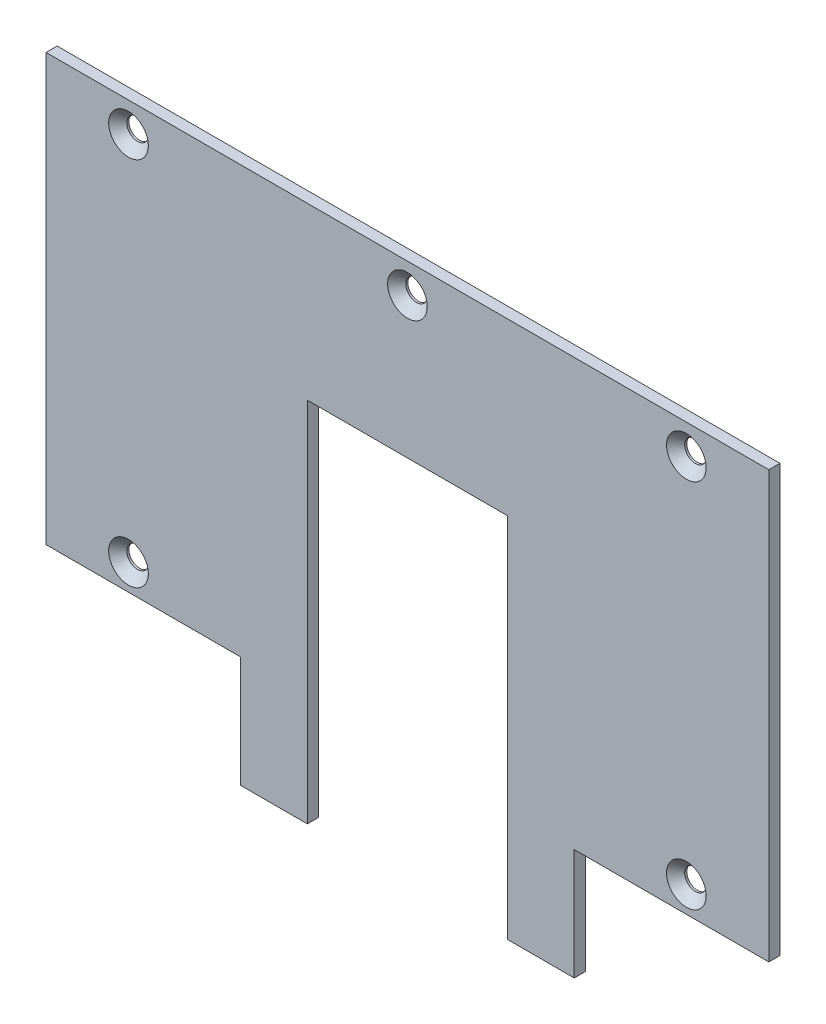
ISO-10303-21;
HEADER;
FILE_DESCRIPTION(('STEP AP214'),'2;1');
FILE_NAME('part.step','',(''),(''),'','','');
FILE_SCHEMA(('AUTOMOTIVE_DESIGN { 1 0 10303 214 1 1 1 1 }'));
ENDSEC;
DATA;
#1=APPLICATION_CONTEXT('core data for automotive mechanical design processes');
#2=APPLICATION_PROTOCOL_DEFINITION('international standard','automotive_design',2000,#1);
#3=PRODUCT_CONTEXT('',#1,'mechanical');
#4=PRODUCT('Part','Part','',(#3));
#5=PRODUCT_RELATED_PRODUCT_CATEGORY('part','',(#4));
#6=PRODUCT_DEFINITION_FORMATION('','',#4);
#7=PRODUCT_DEFINITION_CONTEXT('part definition',#1,'design');
#8=PRODUCT_DEFINITION('design','',#6,#7);
#9=PRODUCT_DEFINITION_SHAPE('','',#8);
#10=(LENGTH_UNIT() NAMED_UNIT(*) SI_UNIT(.MILLI.,.METRE.));
#11=(NAMED_UNIT(*) PLANE_ANGLE_UNIT() SI_UNIT($,.RADIAN.));
#12=(NAMED_UNIT(*) SI_UNIT($,.STERADIAN.) SOLID_ANGLE_UNIT());
#13=UNCERTAINTY_MEASURE_WITH_UNIT(LENGTH_MEASURE(1.E-05),#10,'distance_accuracy_value','');
#14=(GEOMETRIC_REPRESENTATION_CONTEXT(3) GLOBAL_UNCERTAINTY_ASSIGNED_CONTEXT((#13)) GLOBAL_UNIT_ASSIGNED_CONTEXT((#10,
#11,#12)) REPRESENTATION_CONTEXT('',''));
#15=CARTESIAN_POINT('',(0.,0.,0.));
#16=DIRECTION('',(0.,0.,1.));
#17=DIRECTION('',(1.,0.,0.));
#18=AXIS2_PLACEMENT_3D('',#15,#16,#17);
#19=CARTESIAN_POINT('',(0.,31.9897494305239,0.));
#20=DIRECTION('',(0.,0.,1.));
#21=DIRECTION('',(1.,0.,0.));
#22=AXIS2_PLACEMENT_3D('',#19,#20,#21);
#23=PLANE('',#22);
#24=CARTESIAN_POINT('',(-75.25,-8.00000000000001,0.));
#25=DIRECTION('',(0.,0.,1.));
#26=DIRECTION('',(1.,0.,0.));
#27=AXIS2_PLACEMENT_3D('',#24,#25,#26);
#28=CIRCLE('',#27,5.34999999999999);
#29=CARTESIAN_POINT('',(-69.9,-8.00000000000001,0.));
#30=VERTEX_POINT('',#29);
#31=EDGE_CURVE('E125',#30,#30,#28,.F.);
#32=ORIENTED_EDGE('',*,*,#31,.T.);
#33=EDGE_LOOP('',(#32));
#34=FACE_BOUND('',#33,.T.);
#35=CARTESIAN_POINT('',(-75.25,92.,0.));
#36=DIRECTION('',(0.,0.,1.));
#37=DIRECTION('',(1.,0.,0.));
#38=AXIS2_PLACEMENT_3D('',#35,#36,#37);
#39=CIRCLE('',#38,5.34999999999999);
#40=CARTESIAN_POINT('',(-69.9,92.,0.));
#41=VERTEX_POINT('',#40);
#42=EDGE_CURVE('E148',#41,#41,#39,.F.);
#43=ORIENTED_EDGE('',*,*,#42,.T.);
#44=EDGE_LOOP('',(#43));
#45=FACE_BOUND('',#44,.T.);
#46=CARTESIAN_POINT('',(0.,92.,0.));
#47=DIRECTION('',(0.,0.,1.));
#48=DIRECTION('',(1.,0.,0.));
#49=AXIS2_PLACEMENT_3D('',#46,#47,#48);
#50=CIRCLE('',#49,5.35);
#51=CARTESIAN_POINT('',(5.35000000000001,92.,0.));
#52=VERTEX_POINT('',#51);
#53=EDGE_CURVE('E151',#52,#52,#50,.F.);
#54=ORIENTED_EDGE('',*,*,#53,.T.);
#55=EDGE_LOOP('',(#54));
#56=FACE_BOUND('',#55,.T.);
#57=CARTESIAN_POINT('',(75.25,92.,0.));
#58=DIRECTION('',(0.,0.,1.));
#59=DIRECTION('',(1.,0.,0.));
#60=AXIS2_PLACEMENT_3D('',#57,#58,#59);
#61=CIRCLE('',#60,5.35);
#62=CARTESIAN_POINT('',(80.6,92.,0.));
#63=VERTEX_POINT('',#62);
#64=EDGE_CURVE('E153',#63,#63,#61,.F.);
#65=ORIENTED_EDGE('',*,*,#64,.T.);
#66=EDGE_LOOP('',(#65));
#67=FACE_BOUND('',#66,.T.);
#68=CARTESIAN_POINT('',(75.25,-8.,0.));
#69=DIRECTION('',(0.,0.,1.));
#70=DIRECTION('',(1.,0.,0.));
#71=AXIS2_PLACEMENT_3D('',#68,#69,#70);
#72=CIRCLE('',#71,5.35);
#73=CARTESIAN_POINT('',(80.6,-8.,0.));
#74=VERTEX_POINT('',#73);
#75=EDGE_CURVE('E19',#74,#74,#72,.F.);
#76=ORIENTED_EDGE('',*,*,#75,.T.);
#77=EDGE_LOOP('',(#76));
#78=FACE_BOUND('',#77,.T.);
#79=DIRECTION('',(0.,1.,0.));
#80=VECTOR('',#79,1.);
#81=CARTESIAN_POINT('',(-45.,-15.,0.));
#82=LINE('',#81,#80);
#83=CARTESIAN_POINT('',(-45.,-45.,0.));
#84=VERTEX_POINT('',#83);
#85=CARTESIAN_POINT('',(-45.,-15.,0.));
#86=VERTEX_POINT('',#85);
#87=EDGE_CURVE('E345',#84,#86,#82,.T.);
#88=ORIENTED_EDGE('',*,*,#87,.F.);
#89=DIRECTION('',(1.,0.,0.));
#90=VECTOR('',#89,1.);
#91=CARTESIAN_POINT('',(-45.,-45.,0.));
#92=LINE('',#91,#90);
#93=CARTESIAN_POINT('',(-27.,-45.,0.));
#94=VERTEX_POINT('',#93);
#95=EDGE_CURVE('E341',#94,#84,#92,.F.);
#96=ORIENTED_EDGE('',*,*,#95,.F.);
#97=DIRECTION('',(0.,1.,0.));
#98=VECTOR('',#97,1.);
#99=CARTESIAN_POINT('',(-27.,-45.,0.));
#100=LINE('',#99,#98);
#101=CARTESIAN_POINT('',(-27.,54.,0.));
#102=VERTEX_POINT('',#101);
#103=EDGE_CURVE('E338',#102,#94,#100,.F.);
#104=ORIENTED_EDGE('',*,*,#103,.F.);
#105=DIRECTION('',(1.,0.,0.));
#106=VECTOR('',#105,1.);
#107=CARTESIAN_POINT('',(-27.,54.,0.));
#108=LINE('',#107,#106);
#109=CARTESIAN_POINT('',(27.,54.,0.));
#110=VERTEX_POINT('',#109);
#111=EDGE_CURVE('E121',#110,#102,#108,.F.);
#112=ORIENTED_EDGE('',*,*,#111,.F.);
#113=DIRECTION('',(0.,1.,0.));
#114=VECTOR('',#113,1.);
#115=CARTESIAN_POINT('',(27.,54.,0.));
#116=LINE('',#115,#114);
#117=CARTESIAN_POINT('',(27.,-45.,0.));
#118=VERTEX_POINT('',#117);
#119=EDGE_CURVE('E116',#118,#110,#116,.T.);
#120=ORIENTED_EDGE('',*,*,#119,.F.);
#121=DIRECTION('',(1.,0.,0.));
#122=VECTOR('',#121,1.);
#123=CARTESIAN_POINT('',(27.,-45.,0.));
#124=LINE('',#123,#122);
#125=CARTESIAN_POINT('',(45.,-45.,0.));
#126=VERTEX_POINT('',#125);
#127=EDGE_CURVE('E107',#126,#118,#124,.F.);
#128=ORIENTED_EDGE('',*,*,#127,.F.);
#129=DIRECTION('',(0.,1.,0.));
#130=VECTOR('',#129,1.);
#131=CARTESIAN_POINT('',(45.,-45.,0.));
#132=LINE('',#131,#130);
#133=CARTESIAN_POINT('',(45.,-15.,0.));
#134=VERTEX_POINT('',#133);
#135=EDGE_CURVE('E102',#134,#126,#132,.F.);
#136=ORIENTED_EDGE('',*,*,#135,.F.);
#137=DIRECTION('',(1.,0.,0.));
#138=VECTOR('',#137,1.);
#139=CARTESIAN_POINT('',(45.,-15.,0.));
#140=LINE('',#139,#138);
#141=CARTESIAN_POINT('',(97.5,-15.,0.));
#142=VERTEX_POINT('',#141);
#143=EDGE_CURVE('E365',#142,#134,#140,.F.);
#144=ORIENTED_EDGE('',*,*,#143,.F.);
#145=DIRECTION('',(0.,1.,0.));
#146=VECTOR('',#145,1.);
#147=CARTESIAN_POINT('',(97.5,-15.,0.));
#148=LINE('',#147,#146);
#149=CARTESIAN_POINT('',(97.5,100.,0.));
#150=VERTEX_POINT('',#149);
#151=EDGE_CURVE('E361',#150,#142,#148,.F.);
#152=ORIENTED_EDGE('',*,*,#151,.F.);
#153=DIRECTION('',(1.,0.,0.));
#154=VECTOR('',#153,1.);
#155=CARTESIAN_POINT('',(97.5,100.,0.));
#156=LINE('',#155,#154);
#157=CARTESIAN_POINT('',(-97.5,100.,0.));
#158=VERTEX_POINT('',#157);
#159=EDGE_CURVE('E357',#158,#150,#156,.T.);
#160=ORIENTED_EDGE('',*,*,#159,.F.);
#161=DIRECTION('',(0.,1.,0.));
#162=VECTOR('',#161,1.);
#163=CARTESIAN_POINT('',(-97.5,100.,0.));
#164=LINE('',#163,#162);
#165=CARTESIAN_POINT('',(-97.5,-15.,0.));
#166=VERTEX_POINT('',#165);
#167=EDGE_CURVE('E353',#166,#158,#164,.T.);
#168=ORIENTED_EDGE('',*,*,#167,.F.);
#169=DIRECTION('',(1.,0.,0.));
#170=VECTOR('',#169,1.);
#171=CARTESIAN_POINT('',(-97.5,-15.,0.));
#172=LINE('',#171,#170);
#173=EDGE_CURVE('E349',#86,#166,#172,.F.);
#174=ORIENTED_EDGE('',*,*,#173,.F.);
#175=EDGE_LOOP('',(#88,#96,#104,#112,#120,#128,#136,#144,#152,#160,#168,#174));
#176=FACE_BOUND('',#175,.T.);
#177=ADVANCED_FACE('F15',(#34,#45,#56,#67,#78,#176),#23,.T.);
#178=CARTESIAN_POINT('',(75.25,-8.,0.));
#179=DIRECTION('',(0.,0.,1.));
#180=DIRECTION('',(1.,0.,0.));
#181=AXIS2_PLACEMENT_3D('',#178,#179,#180);
#182=CONICAL_SURFACE('',#181,5.34999999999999,0.785398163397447);
#183=CARTESIAN_POINT('',(75.25,-8.,-2.44999999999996));
#184=DIRECTION('',(0.,0.,-1.));
#185=DIRECTION('',(-1.,0.,0.));
#186=AXIS2_PLACEMENT_3D('',#183,#184,#185);
#187=CIRCLE('',#186,2.9);
#188=CARTESIAN_POINT('',(72.35,-8.,-2.44999999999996));
#189=VERTEX_POINT('',#188);
#190=EDGE_CURVE('E327',#189,#189,#187,.T.);
#191=ORIENTED_EDGE('',*,*,#190,.T.);
#192=EDGE_LOOP('',(#191));
#193=FACE_BOUND('',#192,.T.);
#194=ORIENTED_EDGE('',*,*,#75,.F.);
#195=EDGE_LOOP('',(#194));
#196=FACE_BOUND('',#195,.T.);
#197=ADVANCED_FACE('F161',(#193,#196),#182,.F.);
#198=CARTESIAN_POINT('',(75.25,92.,0.));
#199=DIRECTION('',(0.,0.,1.));
#200=DIRECTION('',(1.,0.,0.));
#201=AXIS2_PLACEMENT_3D('',#198,#199,#200);
#202=CONICAL_SURFACE('',#201,5.34999999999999,0.785398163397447);
#203=CARTESIAN_POINT('',(75.25,92.,-2.44999999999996));
#204=DIRECTION('',(0.,0.,-1.));
#205=DIRECTION('',(-1.,0.,0.));
#206=AXIS2_PLACEMENT_3D('',#203,#204,#205);
#207=CIRCLE('',#206,2.89999999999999);
#208=CARTESIAN_POINT('',(72.35,92.,-2.44999999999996));
#209=VERTEX_POINT('',#208);
#210=EDGE_CURVE('E322',#209,#209,#207,.T.);
#211=ORIENTED_EDGE('',*,*,#210,.T.);
#212=EDGE_LOOP('',(#211));
#213=FACE_BOUND('',#212,.T.);
#214=ORIENTED_EDGE('',*,*,#64,.F.);
#215=EDGE_LOOP('',(#214));
#216=FACE_BOUND('',#215,.T.);
#217=ADVANCED_FACE('F163',(#213,#216),#202,.F.);
#218=CARTESIAN_POINT('',(0.,92.,0.));
#219=DIRECTION('',(0.,0.,1.));
#220=DIRECTION('',(1.,0.,0.));
#221=AXIS2_PLACEMENT_3D('',#218,#219,#220);
#222=CONICAL_SURFACE('',#221,5.35,0.785398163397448);
#223=CARTESIAN_POINT('',(0.,92.,-2.44999999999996));
#224=DIRECTION('',(0.,0.,-1.));
#225=DIRECTION('',(-1.,0.,0.));
#226=AXIS2_PLACEMENT_3D('',#223,#224,#225);
#227=CIRCLE('',#226,2.9);
#228=CARTESIAN_POINT('',(-2.89999999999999,92.,-2.44999999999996));
#229=VERTEX_POINT('',#228);
#230=EDGE_CURVE('E317',#229,#229,#227,.T.);
#231=ORIENTED_EDGE('',*,*,#230,.T.);
#232=EDGE_LOOP('',(#231));
#233=FACE_BOUND('',#232,.T.);
#234=ORIENTED_EDGE('',*,*,#53,.F.);
#235=EDGE_LOOP('',(#234));
#236=FACE_BOUND('',#235,.T.);
#237=ADVANCED_FACE('F171',(#233,#236),#222,.F.);
#238=CARTESIAN_POINT('',(-75.25,92.,0.));
#239=DIRECTION('',(0.,0.,1.));
#240=DIRECTION('',(1.,0.,0.));
#241=AXIS2_PLACEMENT_3D('',#238,#239,#240);
#242=CONICAL_SURFACE('',#241,5.34999999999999,0.785398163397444);
#243=CARTESIAN_POINT('',(-75.25,92.,-2.44999999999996));
#244=DIRECTION('',(0.,0.,-1.));
#245=DIRECTION('',(0.,1.,0.));
#246=AXIS2_PLACEMENT_3D('',#243,#244,#245);
#247=CIRCLE('',#246,2.9);
#248=CARTESIAN_POINT('',(-75.25,94.9,-2.44999999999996));
#249=VERTEX_POINT('',#248);
#250=EDGE_CURVE('E264',#249,#249,#247,.T.);
#251=ORIENTED_EDGE('',*,*,#250,.T.);
#252=EDGE_LOOP('',(#251));
#253=FACE_BOUND('',#252,.T.);
#254=ORIENTED_EDGE('',*,*,#42,.F.);
#255=EDGE_LOOP('',(#254));
#256=FACE_BOUND('',#255,.T.);
#257=ADVANCED_FACE('F235',(#253,#256),#242,.F.);
#258=CARTESIAN_POINT('',(-75.25,-8.00000000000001,0.));
#259=DIRECTION('',(0.,0.,1.));
#260=DIRECTION('',(1.,0.,0.));
#261=AXIS2_PLACEMENT_3D('',#258,#259,#260);
#262=CONICAL_SURFACE('',#261,5.34999999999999,0.785398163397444);
#263=CARTESIAN_POINT('',(-75.25,-8.,-2.44999999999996));
#264=DIRECTION('',(0.,0.,-1.));
#265=DIRECTION('',(0.,1.,0.));
#266=AXIS2_PLACEMENT_3D('',#263,#264,#265);
#267=CIRCLE('',#266,2.90000000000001);
#268=CARTESIAN_POINT('',(-75.25,-5.09999999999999,-2.44999999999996));
#269=VERTEX_POINT('',#268);
#270=EDGE_CURVE('E312',#269,#269,#267,.T.);
#271=ORIENTED_EDGE('',*,*,#270,.T.);
#272=EDGE_LOOP('',(#271));
#273=FACE_BOUND('',#272,.T.);
#274=ORIENTED_EDGE('',*,*,#31,.F.);
#275=EDGE_LOOP('',(#274));
#276=FACE_BOUND('',#275,.T.);
#277=ADVANCED_FACE('F231',(#273,#276),#262,.F.);
#278=CARTESIAN_POINT('',(27.,54.,0.));
#279=DIRECTION('',(-1.,0.,0.));
#280=DIRECTION('',(0.,0.,1.));
#281=AXIS2_PLACEMENT_3D('',#278,#279,#280);
#282=PLANE('',#281);
#283=ORIENTED_EDGE('',*,*,#119,.T.);
#284=DIRECTION('',(0.,0.,-1.));
#285=VECTOR('',#284,1.);
#286=CARTESIAN_POINT('',(27.,54.,0.));
#287=LINE('',#286,#285);
#288=CARTESIAN_POINT('',(27.,54.,-3.));
#289=VERTEX_POINT('',#288);
#290=EDGE_CURVE('E335',#289,#110,#287,.F.);
#291=ORIENTED_EDGE('',*,*,#290,.F.);
#292=DIRECTION('',(0.,1.,0.));
#293=VECTOR('',#292,1.);
#294=CARTESIAN_POINT('',(27.,31.9897494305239,-3.));
#295=LINE('',#294,#293);
#296=CARTESIAN_POINT('',(27.,-45.,-3.));
#297=VERTEX_POINT('',#296);
#298=EDGE_CURVE('E129',#289,#297,#295,.F.);
#299=ORIENTED_EDGE('',*,*,#298,.T.);
#300=DIRECTION('',(0.,0.,-1.));
#301=VECTOR('',#300,1.);
#302=CARTESIAN_POINT('',(27.,-45.,0.));
#303=LINE('',#302,#301);
#304=EDGE_CURVE('E112',#118,#297,#303,.T.);
#305=ORIENTED_EDGE('',*,*,#304,.F.);
#306=EDGE_LOOP('',(#283,#291,#299,#305));
#307=FACE_BOUND('',#306,.T.);
#308=ADVANCED_FACE('F128',(#307),#282,.T.);
#309=CARTESIAN_POINT('',(27.,-45.,0.));
#310=DIRECTION('',(0.,-1.,0.));
#311=DIRECTION('',(0.,0.,-1.));
#312=AXIS2_PLACEMENT_3D('',#309,#310,#311);
#313=PLANE('',#312);
#314=ORIENTED_EDGE('',*,*,#127,.T.);
#315=ORIENTED_EDGE('',*,*,#304,.T.);
#316=DIRECTION('',(1.,0.,0.));
#317=VECTOR('',#316,1.);
#318=CARTESIAN_POINT('',(0.,-45.,-3.));
#319=LINE('',#318,#317);
#320=CARTESIAN_POINT('',(45.,-45.,-3.));
#321=VERTEX_POINT('',#320);
#322=EDGE_CURVE('E309',#297,#321,#319,.T.);
#323=ORIENTED_EDGE('',*,*,#322,.T.);
#324=DIRECTION('',(0.,0.,-1.));
#325=VECTOR('',#324,1.);
#326=CARTESIAN_POINT('',(45.,-45.,0.));
#327=LINE('',#326,#325);
#328=EDGE_CURVE('E114',#126,#321,#327,.T.);
#329=ORIENTED_EDGE('',*,*,#328,.F.);
#330=EDGE_LOOP('',(#314,#315,#323,#329));
#331=FACE_BOUND('',#330,.T.);
#332=ADVANCED_FACE('F109',(#331),#313,.T.);
#333=CARTESIAN_POINT('',(45.,-45.,0.));
#334=DIRECTION('',(1.,0.,0.));
#335=DIRECTION('',(0.,0.,-1.));
#336=AXIS2_PLACEMENT_3D('',#333,#334,#335);
#337=PLANE('',#336);
#338=ORIENTED_EDGE('',*,*,#135,.T.);
#339=ORIENTED_EDGE('',*,*,#328,.T.);
#340=DIRECTION('',(0.,1.,0.));
#341=VECTOR('',#340,1.);
#342=CARTESIAN_POINT('',(45.,31.9897494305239,-3.));
#343=LINE('',#342,#341);
#344=CARTESIAN_POINT('',(45.,-15.,-3.));
#345=VERTEX_POINT('',#344);
#346=EDGE_CURVE('E306',#321,#345,#343,.T.);
#347=ORIENTED_EDGE('',*,*,#346,.T.);
#348=DIRECTION('',(0.,0.,-1.));
#349=VECTOR('',#348,1.);
#350=CARTESIAN_POINT('',(45.,-15.,0.));
#351=LINE('',#350,#349);
#352=EDGE_CURVE('E363',#134,#345,#351,.T.);
#353=ORIENTED_EDGE('',*,*,#352,.F.);
#354=EDGE_LOOP('',(#338,#339,#347,#353));
#355=FACE_BOUND('',#354,.T.);
#356=ADVANCED_FACE('F224',(#355),#337,.T.);
#357=CARTESIAN_POINT('',(45.,-15.,0.));
#358=DIRECTION('',(0.,-1.,0.));
#359=DIRECTION('',(0.,0.,-1.));
#360=AXIS2_PLACEMENT_3D('',#357,#358,#359);
#361=PLANE('',#360);
#362=ORIENTED_EDGE('',*,*,#143,.T.);
#363=ORIENTED_EDGE('',*,*,#352,.T.);
#364=DIRECTION('',(1.,0.,0.));
#365=VECTOR('',#364,1.);
#366=CARTESIAN_POINT('',(0.,-15.,-3.));
#367=LINE('',#366,#365);
#368=CARTESIAN_POINT('',(97.5,-15.,-3.));
#369=VERTEX_POINT('',#368);
#370=EDGE_CURVE('E303',#345,#369,#367,.T.);
#371=ORIENTED_EDGE('',*,*,#370,.T.);
#372=DIRECTION('',(0.,0.,-1.));
#373=VECTOR('',#372,1.);
#374=CARTESIAN_POINT('',(97.5,-15.,0.));
#375=LINE('',#374,#373);
#376=EDGE_CURVE('E359',#142,#369,#375,.T.);
#377=ORIENTED_EDGE('',*,*,#376,.F.);
#378=EDGE_LOOP('',(#362,#363,#371,#377));
#379=FACE_BOUND('',#378,.T.);
#380=ADVANCED_FACE('F220',(#379),#361,.T.);
#381=CARTESIAN_POINT('',(97.5,-15.,0.));
#382=DIRECTION('',(1.,0.,0.));
#383=DIRECTION('',(0.,0.,-1.));
#384=AXIS2_PLACEMENT_3D('',#381,#382,#383);
#385=PLANE('',#384);
#386=ORIENTED_EDGE('',*,*,#151,.T.);
#387=ORIENTED_EDGE('',*,*,#376,.T.);
#388=DIRECTION('',(0.,1.,0.));
#389=VECTOR('',#388,1.);
#390=CARTESIAN_POINT('',(97.5,31.9897494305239,-3.));
#391=LINE('',#390,#389);
#392=CARTESIAN_POINT('',(97.5,100.,-3.));
#393=VERTEX_POINT('',#392);
#394=EDGE_CURVE('E300',#369,#393,#391,.T.);
#395=ORIENTED_EDGE('',*,*,#394,.T.);
#396=DIRECTION('',(0.,0.,1.));
#397=VECTOR('',#396,1.);
#398=CARTESIAN_POINT('',(97.5,100.,0.));
#399=LINE('',#398,#397);
#400=EDGE_CURVE('E355',#150,#393,#399,.F.);
#401=ORIENTED_EDGE('',*,*,#400,.F.);
#402=EDGE_LOOP('',(#386,#387,#395,#401));
#403=FACE_BOUND('',#402,.T.);
#404=ADVANCED_FACE('F216',(#403),#385,.T.);
#405=CARTESIAN_POINT('',(97.5,100.,0.));
#406=DIRECTION('',(0.,1.,0.));
#407=DIRECTION('',(0.,0.,1.));
#408=AXIS2_PLACEMENT_3D('',#405,#406,#407);
#409=PLANE('',#408);
#410=ORIENTED_EDGE('',*,*,#159,.T.);
#411=ORIENTED_EDGE('',*,*,#400,.T.);
#412=DIRECTION('',(1.,0.,0.));
#413=VECTOR('',#412,1.);
#414=CARTESIAN_POINT('',(0.,100.,-3.));
#415=LINE('',#414,#413);
#416=CARTESIAN_POINT('',(-97.5,100.,-3.));
#417=VERTEX_POINT('',#416);
#418=EDGE_CURVE('E297',#393,#417,#415,.F.);
#419=ORIENTED_EDGE('',*,*,#418,.T.);
#420=DIRECTION('',(0.,0.,1.));
#421=VECTOR('',#420,1.);
#422=CARTESIAN_POINT('',(-97.5,100.,0.));
#423=LINE('',#422,#421);
#424=EDGE_CURVE('E351',#158,#417,#423,.F.);
#425=ORIENTED_EDGE('',*,*,#424,.F.);
#426=EDGE_LOOP('',(#410,#411,#419,#425));
#427=FACE_BOUND('',#426,.T.);
#428=ADVANCED_FACE('F212',(#427),#409,.T.);
#429=CARTESIAN_POINT('',(-97.5,100.,0.));
#430=DIRECTION('',(-1.,0.,0.));
#431=DIRECTION('',(0.,0.,1.));
#432=AXIS2_PLACEMENT_3D('',#429,#430,#431);
#433=PLANE('',#432);
#434=ORIENTED_EDGE('',*,*,#167,.T.);
#435=ORIENTED_EDGE('',*,*,#424,.T.);
#436=DIRECTION('',(0.,1.,0.));
#437=VECTOR('',#436,1.);
#438=CARTESIAN_POINT('',(-97.5,31.9897494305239,-3.));
#439=LINE('',#438,#437);
#440=CARTESIAN_POINT('',(-97.5,-15.,-3.));
#441=VERTEX_POINT('',#440);
#442=EDGE_CURVE('E294',#417,#441,#439,.F.);
#443=ORIENTED_EDGE('',*,*,#442,.T.);
#444=DIRECTION('',(0.,0.,-1.));
#445=VECTOR('',#444,1.);
#446=CARTESIAN_POINT('',(-97.5,-15.,0.));
#447=LINE('',#446,#445);
#448=EDGE_CURVE('E347',#166,#441,#447,.T.);
#449=ORIENTED_EDGE('',*,*,#448,.F.);
#450=EDGE_LOOP('',(#434,#435,#443,#449));
#451=FACE_BOUND('',#450,.T.);
#452=ADVANCED_FACE('F208',(#451),#433,.T.);
#453=CARTESIAN_POINT('',(-97.5,-15.,0.));
#454=DIRECTION('',(0.,-1.,0.));
#455=DIRECTION('',(0.,0.,-1.));
#456=AXIS2_PLACEMENT_3D('',#453,#454,#455);
#457=PLANE('',#456);
#458=ORIENTED_EDGE('',*,*,#173,.T.);
#459=ORIENTED_EDGE('',*,*,#448,.T.);
#460=DIRECTION('',(1.,0.,0.));
#461=VECTOR('',#460,1.);
#462=CARTESIAN_POINT('',(0.,-15.,-3.));
#463=LINE('',#462,#461);
#464=CARTESIAN_POINT('',(-45.,-15.,-3.));
#465=VERTEX_POINT('',#464);
#466=EDGE_CURVE('E288',#441,#465,#463,.T.);
#467=ORIENTED_EDGE('',*,*,#466,.T.);
#468=DIRECTION('',(0.,0.,1.));
#469=VECTOR('',#468,1.);
#470=CARTESIAN_POINT('',(-45.,-15.,0.));
#471=LINE('',#470,#469);
#472=EDGE_CURVE('E343',#86,#465,#471,.F.);
#473=ORIENTED_EDGE('',*,*,#472,.F.);
#474=EDGE_LOOP('',(#458,#459,#467,#473));
#475=FACE_BOUND('',#474,.T.);
#476=ADVANCED_FACE('F204',(#475),#457,.T.);
#477=CARTESIAN_POINT('',(-45.,-15.,0.));
#478=DIRECTION('',(-1.,0.,0.));
#479=DIRECTION('',(0.,0.,1.));
#480=AXIS2_PLACEMENT_3D('',#477,#478,#479);
#481=PLANE('',#480);
#482=ORIENTED_EDGE('',*,*,#87,.T.);
#483=ORIENTED_EDGE('',*,*,#472,.T.);
#484=DIRECTION('',(0.,1.,0.));
#485=VECTOR('',#484,1.);
#486=CARTESIAN_POINT('',(-45.,31.9897494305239,-3.));
#487=LINE('',#486,#485);
#488=CARTESIAN_POINT('',(-45.,-45.,-3.));
#489=VERTEX_POINT('',#488);
#490=EDGE_CURVE('E286',#465,#489,#487,.F.);
#491=ORIENTED_EDGE('',*,*,#490,.T.);
#492=DIRECTION('',(0.,0.,-1.));
#493=VECTOR('',#492,1.);
#494=CARTESIAN_POINT('',(-45.,-45.,0.));
#495=LINE('',#494,#493);
#496=EDGE_CURVE('E285',#84,#489,#495,.T.);
#497=ORIENTED_EDGE('',*,*,#496,.F.);
#498=EDGE_LOOP('',(#482,#483,#491,#497));
#499=FACE_BOUND('',#498,.T.);
#500=ADVANCED_FACE('F200',(#499),#481,.T.);
#501=CARTESIAN_POINT('',(-45.,-45.,0.));
#502=DIRECTION('',(0.,-1.,0.));
#503=DIRECTION('',(0.,0.,-1.));
#504=AXIS2_PLACEMENT_3D('',#501,#502,#503);
#505=PLANE('',#504);
#506=ORIENTED_EDGE('',*,*,#95,.T.);
#507=ORIENTED_EDGE('',*,*,#496,.T.);
#508=DIRECTION('',(1.,0.,0.));
#509=VECTOR('',#508,1.);
#510=CARTESIAN_POINT('',(0.,-45.,-3.));
#511=LINE('',#510,#509);
#512=CARTESIAN_POINT('',(-27.,-45.,-3.));
#513=VERTEX_POINT('',#512);
#514=EDGE_CURVE('E279',#489,#513,#511,.T.);
#515=ORIENTED_EDGE('',*,*,#514,.T.);
#516=DIRECTION('',(0.,0.,-1.));
#517=VECTOR('',#516,1.);
#518=CARTESIAN_POINT('',(-27.,-45.,0.));
#519=LINE('',#518,#517);
#520=EDGE_CURVE('E283',#94,#513,#519,.T.);
#521=ORIENTED_EDGE('',*,*,#520,.F.);
#522=EDGE_LOOP('',(#506,#507,#515,#521));
#523=FACE_BOUND('',#522,.T.);
#524=ADVANCED_FACE('F196',(#523),#505,.T.);
#525=CARTESIAN_POINT('',(-27.,-45.,0.));
#526=DIRECTION('',(1.,0.,0.));
#527=DIRECTION('',(0.,0.,-1.));
#528=AXIS2_PLACEMENT_3D('',#525,#526,#527);
#529=PLANE('',#528);
#530=ORIENTED_EDGE('',*,*,#103,.T.);
#531=ORIENTED_EDGE('',*,*,#520,.T.);
#532=DIRECTION('',(0.,1.,0.));
#533=VECTOR('',#532,1.);
#534=CARTESIAN_POINT('',(-27.,31.9897494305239,-3.));
#535=LINE('',#534,#533);
#536=CARTESIAN_POINT('',(-27.,54.,-3.));
#537=VERTEX_POINT('',#536);
#538=EDGE_CURVE('E276',#513,#537,#535,.T.);
#539=ORIENTED_EDGE('',*,*,#538,.T.);
#540=DIRECTION('',(0.,0.,-1.));
#541=VECTOR('',#540,1.);
#542=CARTESIAN_POINT('',(-27.,54.,0.));
#543=LINE('',#542,#541);
#544=EDGE_CURVE('E34',#102,#537,#543,.T.);
#545=ORIENTED_EDGE('',*,*,#544,.F.);
#546=EDGE_LOOP('',(#530,#531,#539,#545));
#547=FACE_BOUND('',#546,.T.);
#548=ADVANCED_FACE('F193',(#547),#529,.T.);
#549=CARTESIAN_POINT('',(-27.,54.,0.));
#550=DIRECTION('',(0.,-1.,0.));
#551=DIRECTION('',(0.,0.,-1.));
#552=AXIS2_PLACEMENT_3D('',#549,#550,#551);
#553=PLANE('',#552);
#554=ORIENTED_EDGE('',*,*,#111,.T.);
#555=ORIENTED_EDGE('',*,*,#544,.T.);
#556=DIRECTION('',(1.,0.,0.));
#557=VECTOR('',#556,1.);
#558=CARTESIAN_POINT('',(0.,54.,-3.));
#559=LINE('',#558,#557);
#560=EDGE_CURVE('E145',#537,#289,#559,.T.);
#561=ORIENTED_EDGE('',*,*,#560,.T.);
#562=ORIENTED_EDGE('',*,*,#290,.T.);
#563=EDGE_LOOP('',(#554,#555,#561,#562));
#564=FACE_BOUND('',#563,.T.);
#565=ADVANCED_FACE('F189',(#564),#553,.T.);
#566=CARTESIAN_POINT('',(75.25,-8.,-2.44999999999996));
#567=DIRECTION('',(0.,0.,-1.));
#568=DIRECTION('',(-1.,0.,0.));
#569=AXIS2_PLACEMENT_3D('',#566,#567,#568);
#570=CYLINDRICAL_SURFACE('',#569,2.9);
#571=ORIENTED_EDGE('',*,*,#190,.F.);
#572=EDGE_LOOP('',(#571));
#573=FACE_BOUND('',#572,.T.);
#574=CARTESIAN_POINT('',(75.25,-8.,-3.));
#575=DIRECTION('',(0.,0.,-1.));
#576=DIRECTION('',(-1.,0.,0.));
#577=AXIS2_PLACEMENT_3D('',#574,#575,#576);
#578=CIRCLE('',#577,2.9);
#579=CARTESIAN_POINT('',(72.35,-8.,-3.));
#580=VERTEX_POINT('',#579);
#581=EDGE_CURVE('E142',#580,#580,#578,.T.);
#582=ORIENTED_EDGE('',*,*,#581,.T.);
#583=EDGE_LOOP('',(#582));
#584=FACE_BOUND('',#583,.T.);
#585=ADVANCED_FACE('F192',(#573,#584),#570,.F.);
#586=CARTESIAN_POINT('',(75.25,92.,-2.44999999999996));
#587=DIRECTION('',(0.,0.,-1.));
#588=DIRECTION('',(-1.,0.,0.));
#589=AXIS2_PLACEMENT_3D('',#586,#587,#588);
#590=CYLINDRICAL_SURFACE('',#589,2.89999999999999);
#591=ORIENTED_EDGE('',*,*,#210,.F.);
#592=EDGE_LOOP('',(#591));
#593=FACE_BOUND('',#592,.T.);
#594=CARTESIAN_POINT('',(75.25,92.,-3.));
#595=DIRECTION('',(0.,0.,-1.));
#596=DIRECTION('',(-1.,0.,0.));
#597=AXIS2_PLACEMENT_3D('',#594,#595,#596);
#598=CIRCLE('',#597,2.89999999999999);
#599=CARTESIAN_POINT('',(72.35,92.,-3.));
#600=VERTEX_POINT('',#599);
#601=EDGE_CURVE('E139',#600,#600,#598,.T.);
#602=ORIENTED_EDGE('',*,*,#601,.T.);
#603=EDGE_LOOP('',(#602));
#604=FACE_BOUND('',#603,.T.);
#605=ADVANCED_FACE('F249',(#593,#604),#590,.F.);
#606=CARTESIAN_POINT('',(0.,92.,-2.44999999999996));
#607=DIRECTION('',(0.,0.,-1.));
#608=DIRECTION('',(-1.,0.,0.));
#609=AXIS2_PLACEMENT_3D('',#606,#607,#608);
#610=CYLINDRICAL_SURFACE('',#609,2.9);
#611=ORIENTED_EDGE('',*,*,#230,.F.);
#612=EDGE_LOOP('',(#611));
#613=FACE_BOUND('',#612,.T.);
#614=CARTESIAN_POINT('',(0.,92.,-3.));
#615=DIRECTION('',(0.,0.,-1.));
#616=DIRECTION('',(-1.,0.,0.));
#617=AXIS2_PLACEMENT_3D('',#614,#615,#616);
#618=CIRCLE('',#617,2.9);
#619=CARTESIAN_POINT('',(-2.89999999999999,92.,-3.));
#620=VERTEX_POINT('',#619);
#621=EDGE_CURVE('E136',#620,#620,#618,.T.);
#622=ORIENTED_EDGE('',*,*,#621,.T.);
#623=EDGE_LOOP('',(#622));
#624=FACE_BOUND('',#623,.T.);
#625=ADVANCED_FACE('F253',(#613,#624),#610,.F.);
#626=CARTESIAN_POINT('',(-75.25,92.,-2.44999999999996));
#627=DIRECTION('',(0.,0.,-1.));
#628=DIRECTION('',(0.,1.,0.));
#629=AXIS2_PLACEMENT_3D('',#626,#627,#628);
#630=CYLINDRICAL_SURFACE('',#629,2.9);
#631=ORIENTED_EDGE('',*,*,#250,.F.);
#632=EDGE_LOOP('',(#631));
#633=FACE_BOUND('',#632,.T.);
#634=CARTESIAN_POINT('',(-75.25,92.,-3.));
#635=DIRECTION('',(0.,0.,-1.));
#636=DIRECTION('',(0.,1.,0.));
#637=AXIS2_PLACEMENT_3D('',#634,#635,#636);
#638=CIRCLE('',#637,2.9);
#639=CARTESIAN_POINT('',(-75.25,94.9,-3.));
#640=VERTEX_POINT('',#639);
#641=EDGE_CURVE('E25',#640,#640,#638,.T.);
#642=ORIENTED_EDGE('',*,*,#641,.T.);
#643=EDGE_LOOP('',(#642));
#644=FACE_BOUND('',#643,.T.);
#645=ADVANCED_FACE('F184',(#633,#644),#630,.F.);
#646=CARTESIAN_POINT('',(-75.25,-8.,-2.44999999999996));
#647=DIRECTION('',(0.,0.,-1.));
#648=DIRECTION('',(0.,1.,0.));
#649=AXIS2_PLACEMENT_3D('',#646,#647,#648);
#650=CYLINDRICAL_SURFACE('',#649,2.90000000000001);
#651=ORIENTED_EDGE('',*,*,#270,.F.);
#652=EDGE_LOOP('',(#651));
#653=FACE_BOUND('',#652,.T.);
#654=CARTESIAN_POINT('',(-75.25,-8.,-3.));
#655=DIRECTION('',(0.,0.,-1.));
#656=DIRECTION('',(0.,1.,0.));
#657=AXIS2_PLACEMENT_3D('',#654,#655,#656);
#658=CIRCLE('',#657,2.90000000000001);
#659=CARTESIAN_POINT('',(-75.25,-5.09999999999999,-3.));
#660=VERTEX_POINT('',#659);
#661=EDGE_CURVE('E10',#660,#660,#658,.T.);
#662=ORIENTED_EDGE('',*,*,#661,.T.);
#663=EDGE_LOOP('',(#662));
#664=FACE_BOUND('',#663,.T.);
#665=ADVANCED_FACE('F17',(#653,#664),#650,.F.);
#666=CARTESIAN_POINT('',(0.,31.9897494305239,-3.));
#667=DIRECTION('',(0.,0.,1.));
#668=DIRECTION('',(1.,0.,0.));
#669=AXIS2_PLACEMENT_3D('',#666,#667,#668);
#670=PLANE('',#669);
#671=ORIENTED_EDGE('',*,*,#661,.F.);
#672=EDGE_LOOP('',(#671));
#673=FACE_BOUND('',#672,.T.);
#674=ORIENTED_EDGE('',*,*,#641,.F.);
#675=EDGE_LOOP('',(#674));
#676=FACE_BOUND('',#675,.T.);
#677=ORIENTED_EDGE('',*,*,#621,.F.);
#678=EDGE_LOOP('',(#677));
#679=FACE_BOUND('',#678,.T.);
#680=ORIENTED_EDGE('',*,*,#601,.F.);
#681=EDGE_LOOP('',(#680));
#682=FACE_BOUND('',#681,.T.);
#683=ORIENTED_EDGE('',*,*,#581,.F.);
#684=EDGE_LOOP('',(#683));
#685=FACE_BOUND('',#684,.T.);
#686=ORIENTED_EDGE('',*,*,#538,.F.);
#687=ORIENTED_EDGE('',*,*,#514,.F.);
#688=ORIENTED_EDGE('',*,*,#490,.F.);
#689=ORIENTED_EDGE('',*,*,#466,.F.);
#690=ORIENTED_EDGE('',*,*,#442,.F.);
#691=ORIENTED_EDGE('',*,*,#418,.F.);
#692=ORIENTED_EDGE('',*,*,#394,.F.);
#693=ORIENTED_EDGE('',*,*,#370,.F.);
#694=ORIENTED_EDGE('',*,*,#346,.F.);
#695=ORIENTED_EDGE('',*,*,#322,.F.);
#696=ORIENTED_EDGE('',*,*,#298,.F.);
#697=ORIENTED_EDGE('',*,*,#560,.F.);
#698=EDGE_LOOP('',(#686,#687,#688,#689,#690,#691,#692,#693,#694,#695,#696,#697));
#699=FACE_BOUND('',#698,.T.);
#700=ADVANCED_FACE('F177',(#673,#676,#679,#682,#685,#699),#670,.F.);
#701=CLOSED_SHELL('',(#177,#197,#217,#237,#257,#277,#308,#332,#356,#380,#404,#428,#452,#476,
#500,#524,#548,#565,#585,#605,#625,#645,#665,#700));
#702=MANIFOLD_SOLID_BREP('B1',#701);
#703=ADVANCED_BREP_SHAPE_REPRESENTATION('',(#18,#702),#14);
#704=SHAPE_DEFINITION_REPRESENTATION(#9,#703);
ENDSEC;
END-ISO-10303-21;
